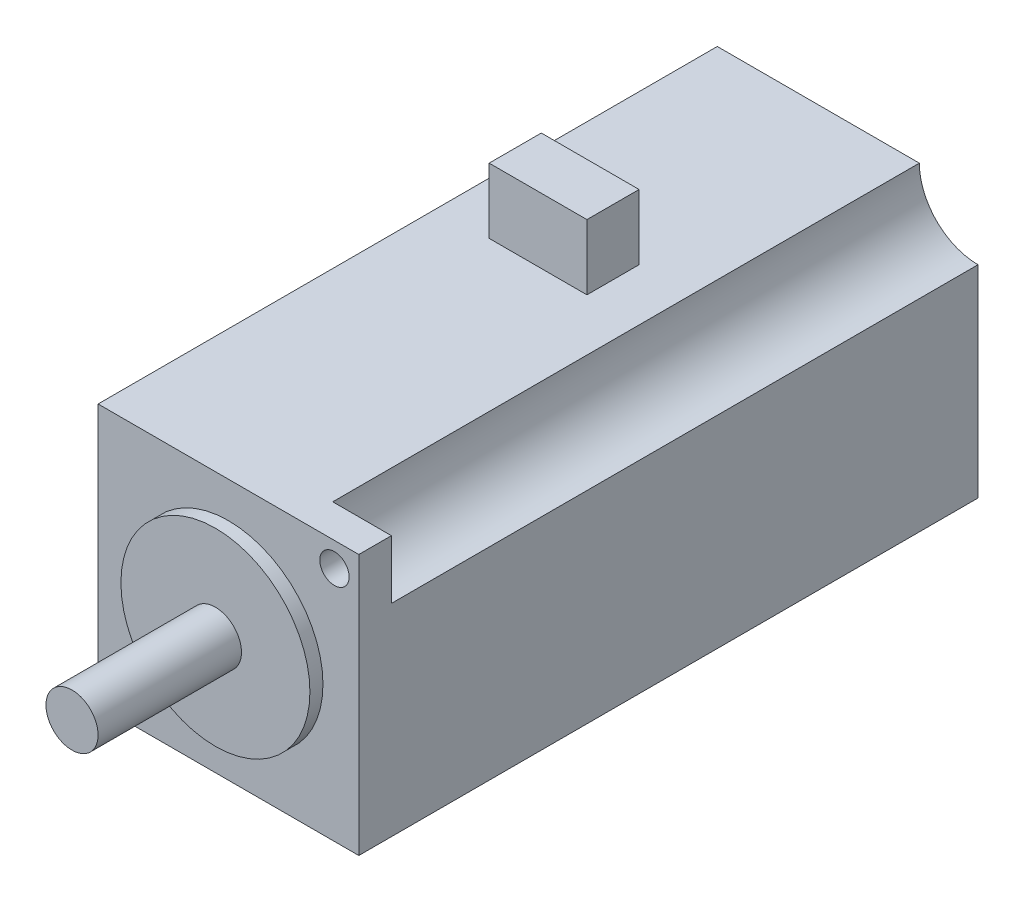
ISO-10303-21;
HEADER;
FILE_DESCRIPTION(('STEP AP214'),'2;1');
FILE_NAME('part.step','',(''),(''),'','','');
FILE_SCHEMA(('AUTOMOTIVE_DESIGN { 1 0 10303 214 1 1 1 1 }'));
ENDSEC;
DATA;
#1=APPLICATION_CONTEXT('core data for automotive mechanical design processes');
#2=APPLICATION_PROTOCOL_DEFINITION('international standard','automotive_design',2000,#1);
#3=PRODUCT_CONTEXT('',#1,'mechanical');
#4=PRODUCT('Part','Part','',(#3));
#5=PRODUCT_RELATED_PRODUCT_CATEGORY('part','',(#4));
#6=PRODUCT_DEFINITION_FORMATION('','',#4);
#7=PRODUCT_DEFINITION_CONTEXT('part definition',#1,'design');
#8=PRODUCT_DEFINITION('design','',#6,#7);
#9=PRODUCT_DEFINITION_SHAPE('','',#8);
#10=(LENGTH_UNIT() NAMED_UNIT(*) SI_UNIT(.MILLI.,.METRE.));
#11=(NAMED_UNIT(*) PLANE_ANGLE_UNIT() SI_UNIT($,.RADIAN.));
#12=(NAMED_UNIT(*) SI_UNIT($,.STERADIAN.) SOLID_ANGLE_UNIT());
#13=UNCERTAINTY_MEASURE_WITH_UNIT(LENGTH_MEASURE(1.E-05),#10,'distance_accuracy_value','');
#14=(GEOMETRIC_REPRESENTATION_CONTEXT(3) GLOBAL_UNCERTAINTY_ASSIGNED_CONTEXT((#13)) GLOBAL_UNIT_ASSIGNED_CONTEXT((#10,
#11,#12)) REPRESENTATION_CONTEXT('',''));
#15=CARTESIAN_POINT('',(0.,0.,0.));
#16=DIRECTION('',(0.,0.,1.));
#17=DIRECTION('',(1.,0.,0.));
#18=AXIS2_PLACEMENT_3D('',#15,#16,#17);
#19=CARTESIAN_POINT('',(7214.09030836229,-378.275127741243,95.));
#20=DIRECTION('',(0.,-1.,0.));
#21=DIRECTION('',(0.,0.,-1.));
#22=AXIS2_PLACEMENT_3D('',#19,#20,#21);
#23=PLANE('',#22);
#24=DIRECTION('',(1.,0.,0.));
#25=VECTOR('',#24,1.);
#26=CARTESIAN_POINT('',(7214.09030836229,-378.275127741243,90.));
#27=LINE('',#26,#25);
#28=CARTESIAN_POINT('',(7205.09030836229,-378.275127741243,90.));
#29=VERTEX_POINT('',#28);
#30=CARTESIAN_POINT('',(7214.09030836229,-378.275127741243,90.));
#31=VERTEX_POINT('',#30);
#32=EDGE_CURVE('E168',#29,#31,#27,.T.);
#33=ORIENTED_EDGE('',*,*,#32,.F.);
#34=DIRECTION('',(0.,0.,-1.));
#35=VECTOR('',#34,1.);
#36=CARTESIAN_POINT('',(7205.09030836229,-378.275127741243,90.));
#37=LINE('',#36,#35);
#38=CARTESIAN_POINT('',(7205.09030836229,-378.275127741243,0.));
#39=VERTEX_POINT('',#38);
#40=EDGE_CURVE('E43',#29,#39,#37,.T.);
#41=ORIENTED_EDGE('',*,*,#40,.T.);
#42=DIRECTION('',(-1.,0.,0.));
#43=VECTOR('',#42,1.);
#44=CARTESIAN_POINT('',(7214.09030836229,-378.275127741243,0.));
#45=LINE('',#44,#43);
#46=CARTESIAN_POINT('',(7174.09030836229,-378.275127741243,0.));
#47=VERTEX_POINT('',#46);
#48=EDGE_CURVE('E209',#39,#47,#45,.T.);
#49=ORIENTED_EDGE('',*,*,#48,.T.);
#50=DIRECTION('',(0.,0.,-1.));
#51=VECTOR('',#50,1.);
#52=CARTESIAN_POINT('',(7174.09030836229,-378.275127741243,95.));
#53=LINE('',#52,#51);
#54=CARTESIAN_POINT('',(7174.09030836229,-378.275127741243,95.));
#55=VERTEX_POINT('',#54);
#56=EDGE_CURVE('E215',#55,#47,#53,.T.);
#57=ORIENTED_EDGE('',*,*,#56,.F.);
#58=DIRECTION('',(-1.,0.,0.));
#59=VECTOR('',#58,1.);
#60=CARTESIAN_POINT('',(7214.09030836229,-378.275127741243,95.));
#61=LINE('',#60,#59);
#62=CARTESIAN_POINT('',(7214.09030836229,-378.275127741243,95.));
#63=VERTEX_POINT('',#62);
#64=EDGE_CURVE('E200',#63,#55,#61,.T.);
#65=ORIENTED_EDGE('',*,*,#64,.F.);
#66=DIRECTION('',(0.,0.,-1.));
#67=VECTOR('',#66,1.);
#68=CARTESIAN_POINT('',(7214.09030836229,-378.275127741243,95.));
#69=LINE('',#68,#67);
#70=EDGE_CURVE('E218',#63,#31,#69,.T.);
#71=ORIENTED_EDGE('',*,*,#70,.T.);
#72=EDGE_LOOP('',(#33,#41,#49,#57,#65,#71));
#73=FACE_BOUND('',#72,.T.);
#74=DIRECTION('',(0.,0.,1.));
#75=VECTOR('',#74,1.);
#76=CARTESIAN_POINT('',(7182.09030836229,-378.275127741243,43.));
#77=LINE('',#76,#75);
#78=CARTESIAN_POINT('',(7182.09030836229,-378.275127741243,35.));
#79=VERTEX_POINT('',#78);
#80=CARTESIAN_POINT('',(7182.09030836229,-378.275127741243,43.));
#81=VERTEX_POINT('',#80);
#82=EDGE_CURVE('E144',#79,#81,#77,.T.);
#83=ORIENTED_EDGE('',*,*,#82,.F.);
#84=DIRECTION('',(-1.,0.,0.));
#85=VECTOR('',#84,1.);
#86=CARTESIAN_POINT('',(7182.09030836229,-378.275127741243,35.));
#87=LINE('',#86,#85);
#88=CARTESIAN_POINT('',(7197.09030836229,-378.275127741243,35.));
#89=VERTEX_POINT('',#88);
#90=EDGE_CURVE('E141',#89,#79,#87,.T.);
#91=ORIENTED_EDGE('',*,*,#90,.F.);
#92=DIRECTION('',(0.,0.,-1.));
#93=VECTOR('',#92,1.);
#94=CARTESIAN_POINT('',(7197.09030836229,-378.275127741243,43.));
#95=LINE('',#94,#93);
#96=CARTESIAN_POINT('',(7197.09030836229,-378.275127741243,43.));
#97=VERTEX_POINT('',#96);
#98=EDGE_CURVE('E55',#97,#89,#95,.T.);
#99=ORIENTED_EDGE('',*,*,#98,.F.);
#100=DIRECTION('',(1.,0.,0.));
#101=VECTOR('',#100,1.);
#102=CARTESIAN_POINT('',(7182.09030836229,-378.275127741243,43.));
#103=LINE('',#102,#101);
#104=EDGE_CURVE('E50',#81,#97,#103,.T.);
#105=ORIENTED_EDGE('',*,*,#104,.F.);
#106=EDGE_LOOP('',(#83,#91,#99,#105));
#107=FACE_BOUND('',#106,.T.);
#108=ADVANCED_FACE('F35',(#73,#107),#23,.F.);
#109=CARTESIAN_POINT('',(7177.826852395,-414.538583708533,95.));
#110=DIRECTION('',(0.,0.,-1.));
#111=DIRECTION('',(-1.,0.,0.));
#112=AXIS2_PLACEMENT_3D('',#109,#110,#111);
#113=CYLINDRICAL_SURFACE('',#112,2.25000000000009);
#114=CARTESIAN_POINT('',(7177.826852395,-414.538583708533,95.));
#115=DIRECTION('',(0.,0.,1.));
#116=DIRECTION('',(1.,0.,0.));
#117=AXIS2_PLACEMENT_3D('',#114,#115,#116);
#118=CIRCLE('',#117,2.25000000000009);
#119=CARTESIAN_POINT('',(7180.076852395,-414.538583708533,95.));
#120=VERTEX_POINT('',#119);
#121=EDGE_CURVE('E185',#120,#120,#118,.T.);
#122=ORIENTED_EDGE('',*,*,#121,.T.);
#123=EDGE_LOOP('',(#122));
#124=FACE_BOUND('',#123,.T.);
#125=CARTESIAN_POINT('',(7177.826852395,-414.538583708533,90.));
#126=DIRECTION('',(0.,0.,-1.));
#127=DIRECTION('',(-1.,0.,0.));
#128=AXIS2_PLACEMENT_3D('',#125,#126,#127);
#129=CIRCLE('',#128,2.25000000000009);
#130=CARTESIAN_POINT('',(7175.576852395,-414.538583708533,90.));
#131=VERTEX_POINT('',#130);
#132=EDGE_CURVE('E154',#131,#131,#129,.T.);
#133=ORIENTED_EDGE('',*,*,#132,.T.);
#134=EDGE_LOOP('',(#133));
#135=FACE_BOUND('',#134,.T.);
#136=ADVANCED_FACE('F230',(#124,#135),#113,.F.);
#137=CARTESIAN_POINT('',(7210.35376432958,-382.011671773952,95.));
#138=DIRECTION('',(0.,0.,-1.));
#139=DIRECTION('',(-1.,0.,0.));
#140=AXIS2_PLACEMENT_3D('',#137,#138,#139);
#141=CYLINDRICAL_SURFACE('',#140,2.25000000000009);
#142=CARTESIAN_POINT('',(7210.35376432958,-382.011671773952,95.));
#143=DIRECTION('',(0.,0.,1.));
#144=DIRECTION('',(1.,0.,0.));
#145=AXIS2_PLACEMENT_3D('',#142,#143,#144);
#146=CIRCLE('',#145,2.25000000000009);
#147=CARTESIAN_POINT('',(7212.60376432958,-382.011671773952,95.));
#148=VERTEX_POINT('',#147);
#149=EDGE_CURVE('E190',#148,#148,#146,.T.);
#150=ORIENTED_EDGE('',*,*,#149,.T.);
#151=EDGE_LOOP('',(#150));
#152=FACE_BOUND('',#151,.T.);
#153=CARTESIAN_POINT('',(7210.35376432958,-382.011671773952,90.));
#154=DIRECTION('',(0.,0.,-1.));
#155=DIRECTION('',(-1.,0.,0.));
#156=AXIS2_PLACEMENT_3D('',#153,#154,#155);
#157=CIRCLE('',#156,2.25000000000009);
#158=CARTESIAN_POINT('',(7208.10376432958,-382.011671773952,90.));
#159=VERTEX_POINT('',#158);
#160=EDGE_CURVE('E166',#159,#159,#157,.T.);
#161=ORIENTED_EDGE('',*,*,#160,.T.);
#162=EDGE_LOOP('',(#161));
#163=FACE_BOUND('',#162,.T.);
#164=ADVANCED_FACE('F318',(#152,#163),#141,.F.);
#165=CARTESIAN_POINT('',(7194.09030836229,-398.275127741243,97.));
#166=DIRECTION('',(0.,0.,1.));
#167=DIRECTION('',(1.,0.,0.));
#168=AXIS2_PLACEMENT_3D('',#165,#166,#167);
#169=PLANE('',#168);
#170=CARTESIAN_POINT('',(7194.09030836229,-398.275127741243,97.));
#171=DIRECTION('',(0.,0.,1.));
#172=DIRECTION('',(1.,0.,0.));
#173=AXIS2_PLACEMENT_3D('',#170,#171,#172);
#174=CIRCLE('',#173,14.4999999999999);
#175=CARTESIAN_POINT('',(7208.59030836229,-398.275127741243,97.));
#176=VERTEX_POINT('',#175);
#177=EDGE_CURVE('E182',#176,#176,#174,.T.);
#178=ORIENTED_EDGE('',*,*,#177,.T.);
#179=EDGE_LOOP('',(#178));
#180=FACE_BOUND('',#179,.T.);
#181=CARTESIAN_POINT('',(7194.09030836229,-398.275127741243,97.));
#182=DIRECTION('',(0.,0.,1.));
#183=DIRECTION('',(1.,0.,0.));
#184=AXIS2_PLACEMENT_3D('',#181,#182,#183);
#185=CIRCLE('',#184,3.99999999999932);
#186=CARTESIAN_POINT('',(7198.09030836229,-398.275127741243,97.));
#187=VERTEX_POINT('',#186);
#188=EDGE_CURVE('E175',#187,#187,#185,.T.);
#189=ORIENTED_EDGE('',*,*,#188,.F.);
#190=EDGE_LOOP('',(#189));
#191=FACE_BOUND('',#190,.T.);
#192=ADVANCED_FACE('F315',(#180,#191),#169,.T.);
#193=CARTESIAN_POINT('',(7214.09030836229,-418.275127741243,95.));
#194=DIRECTION('',(0.,0.,1.));
#195=DIRECTION('',(1.,0.,0.));
#196=AXIS2_PLACEMENT_3D('',#193,#194,#195);
#197=PLANE('',#196);
#198=ORIENTED_EDGE('',*,*,#121,.F.);
#199=EDGE_LOOP('',(#198));
#200=FACE_BOUND('',#199,.T.);
#201=DIRECTION('',(1.,0.,0.));
#202=VECTOR('',#201,1.);
#203=CARTESIAN_POINT('',(7174.09030836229,-418.275127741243,95.));
#204=LINE('',#203,#202);
#205=CARTESIAN_POINT('',(7174.09030836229,-418.275127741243,95.));
#206=VERTEX_POINT('',#205);
#207=CARTESIAN_POINT('',(7214.09030836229,-418.275127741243,95.));
#208=VERTEX_POINT('',#207);
#209=EDGE_CURVE('E194',#206,#208,#204,.T.);
#210=ORIENTED_EDGE('',*,*,#209,.T.);
#211=DIRECTION('',(0.,1.,0.));
#212=VECTOR('',#211,1.);
#213=CARTESIAN_POINT('',(7214.09030836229,-418.275127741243,95.));
#214=LINE('',#213,#212);
#215=EDGE_CURVE('E197',#208,#63,#214,.T.);
#216=ORIENTED_EDGE('',*,*,#215,.T.);
#217=ORIENTED_EDGE('',*,*,#64,.T.);
#218=DIRECTION('',(0.,-1.,0.));
#219=VECTOR('',#218,1.);
#220=CARTESIAN_POINT('',(7174.09030836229,-378.275127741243,95.));
#221=LINE('',#220,#219);
#222=EDGE_CURVE('E202',#55,#206,#221,.T.);
#223=ORIENTED_EDGE('',*,*,#222,.T.);
#224=EDGE_LOOP('',(#210,#216,#217,#223));
#225=FACE_BOUND('',#224,.T.);
#226=ORIENTED_EDGE('',*,*,#149,.F.);
#227=EDGE_LOOP('',(#226));
#228=FACE_BOUND('',#227,.T.);
#229=CARTESIAN_POINT('',(7194.09030836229,-398.275127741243,95.));
#230=DIRECTION('',(0.,0.,1.));
#231=DIRECTION('',(1.,0.,0.));
#232=AXIS2_PLACEMENT_3D('',#229,#230,#231);
#233=CIRCLE('',#232,14.4999999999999);
#234=CARTESIAN_POINT('',(7208.59030836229,-398.275127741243,95.));
#235=VERTEX_POINT('',#234);
#236=EDGE_CURVE('E179',#235,#235,#233,.T.);
#237=ORIENTED_EDGE('',*,*,#236,.F.);
#238=EDGE_LOOP('',(#237));
#239=FACE_BOUND('',#238,.T.);
#240=ADVANCED_FACE('F248',(#200,#225,#228,#239),#197,.T.);
#241=CARTESIAN_POINT('',(7214.09030836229,-418.275127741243,0.));
#242=DIRECTION('',(0.,0.,1.));
#243=DIRECTION('',(1.,0.,0.));
#244=AXIS2_PLACEMENT_3D('',#241,#242,#243);
#245=PLANE('',#244);
#246=DIRECTION('',(1.,0.,0.));
#247=VECTOR('',#246,1.);
#248=CARTESIAN_POINT('',(7174.09030836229,-418.275127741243,0.));
#249=LINE('',#248,#247);
#250=CARTESIAN_POINT('',(7183.09030836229,-418.275127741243,0.));
#251=VERTEX_POINT('',#250);
#252=CARTESIAN_POINT('',(7214.09030836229,-418.275127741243,0.));
#253=VERTEX_POINT('',#252);
#254=EDGE_CURVE('E193',#251,#253,#249,.T.);
#255=ORIENTED_EDGE('',*,*,#254,.F.);
#256=CARTESIAN_POINT('',(7174.09030836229,-418.275127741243,0.));
#257=DIRECTION('',(0.,0.,-1.));
#258=DIRECTION('',(-1.,0.,0.));
#259=AXIS2_PLACEMENT_3D('',#256,#257,#258);
#260=CIRCLE('',#259,9.0000000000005);
#261=CARTESIAN_POINT('',(7174.09030836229,-409.275127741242,0.));
#262=VERTEX_POINT('',#261);
#263=EDGE_CURVE('E145',#262,#251,#260,.T.);
#264=ORIENTED_EDGE('',*,*,#263,.F.);
#265=DIRECTION('',(0.,-1.,0.));
#266=VECTOR('',#265,1.);
#267=CARTESIAN_POINT('',(7174.09030836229,-378.275127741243,0.));
#268=LINE('',#267,#266);
#269=EDGE_CURVE('E198',#47,#262,#268,.T.);
#270=ORIENTED_EDGE('',*,*,#269,.F.);
#271=ORIENTED_EDGE('',*,*,#48,.F.);
#272=CARTESIAN_POINT('',(7214.09030836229,-378.275127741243,0.));
#273=DIRECTION('',(0.,0.,-1.));
#274=DIRECTION('',(-1.,0.,0.));
#275=AXIS2_PLACEMENT_3D('',#272,#273,#274);
#276=CIRCLE('',#275,9.0000000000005);
#277=CARTESIAN_POINT('',(7214.09030836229,-387.275127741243,0.));
#278=VERTEX_POINT('',#277);
#279=EDGE_CURVE('E163',#278,#39,#276,.T.);
#280=ORIENTED_EDGE('',*,*,#279,.F.);
#281=DIRECTION('',(0.,1.,0.));
#282=VECTOR('',#281,1.);
#283=CARTESIAN_POINT('',(7214.09030836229,-418.275127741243,0.));
#284=LINE('',#283,#282);
#285=EDGE_CURVE('E206',#253,#278,#284,.T.);
#286=ORIENTED_EDGE('',*,*,#285,.F.);
#287=EDGE_LOOP('',(#255,#264,#270,#271,#280,#286));
#288=FACE_BOUND('',#287,.T.);
#289=ADVANCED_FACE('F259',(#288),#245,.F.);
#290=CARTESIAN_POINT('',(7174.09030836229,-418.275127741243,95.));
#291=DIRECTION('',(0.,1.,0.));
#292=DIRECTION('',(0.,0.,1.));
#293=AXIS2_PLACEMENT_3D('',#290,#291,#292);
#294=PLANE('',#293);
#295=DIRECTION('',(-1.,0.,0.));
#296=VECTOR('',#295,1.);
#297=CARTESIAN_POINT('',(7174.09030836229,-418.275127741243,90.));
#298=LINE('',#297,#296);
#299=CARTESIAN_POINT('',(7183.09030836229,-418.275127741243,90.));
#300=VERTEX_POINT('',#299);
#301=CARTESIAN_POINT('',(7174.09030836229,-418.275127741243,90.));
#302=VERTEX_POINT('',#301);
#303=EDGE_CURVE('E158',#300,#302,#298,.T.);
#304=ORIENTED_EDGE('',*,*,#303,.F.);
#305=DIRECTION('',(0.,0.,-1.));
#306=VECTOR('',#305,1.);
#307=CARTESIAN_POINT('',(7183.09030836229,-418.275127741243,90.));
#308=LINE('',#307,#306);
#309=EDGE_CURVE('E160',#300,#251,#308,.T.);
#310=ORIENTED_EDGE('',*,*,#309,.T.);
#311=ORIENTED_EDGE('',*,*,#254,.T.);
#312=DIRECTION('',(0.,0.,-1.));
#313=VECTOR('',#312,1.);
#314=CARTESIAN_POINT('',(7214.09030836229,-418.275127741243,95.));
#315=LINE('',#314,#313);
#316=EDGE_CURVE('E221',#208,#253,#315,.T.);
#317=ORIENTED_EDGE('',*,*,#316,.F.);
#318=ORIENTED_EDGE('',*,*,#209,.F.);
#319=DIRECTION('',(0.,0.,-1.));
#320=VECTOR('',#319,1.);
#321=CARTESIAN_POINT('',(7174.09030836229,-418.275127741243,95.));
#322=LINE('',#321,#320);
#323=EDGE_CURVE('E204',#206,#302,#322,.T.);
#324=ORIENTED_EDGE('',*,*,#323,.T.);
#325=EDGE_LOOP('',(#304,#310,#311,#317,#318,#324));
#326=FACE_BOUND('',#325,.T.);
#327=ADVANCED_FACE('F37',(#326),#294,.F.);
#328=CARTESIAN_POINT('',(7214.09030836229,-418.275127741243,95.));
#329=DIRECTION('',(-1.,0.,0.));
#330=DIRECTION('',(0.,0.,1.));
#331=AXIS2_PLACEMENT_3D('',#328,#329,#330);
#332=PLANE('',#331);
#333=ORIENTED_EDGE('',*,*,#285,.T.);
#334=DIRECTION('',(0.,0.,-1.));
#335=VECTOR('',#334,1.);
#336=CARTESIAN_POINT('',(7214.09030836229,-387.275127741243,90.));
#337=LINE('',#336,#335);
#338=CARTESIAN_POINT('',(7214.09030836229,-387.275127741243,90.));
#339=VERTEX_POINT('',#338);
#340=EDGE_CURVE('E172',#278,#339,#337,.F.);
#341=ORIENTED_EDGE('',*,*,#340,.T.);
#342=DIRECTION('',(0.,-1.,0.));
#343=VECTOR('',#342,1.);
#344=CARTESIAN_POINT('',(7214.09030836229,-418.275127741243,90.));
#345=LINE('',#344,#343);
#346=EDGE_CURVE('E170',#31,#339,#345,.T.);
#347=ORIENTED_EDGE('',*,*,#346,.F.);
#348=ORIENTED_EDGE('',*,*,#70,.F.);
#349=ORIENTED_EDGE('',*,*,#215,.F.);
#350=ORIENTED_EDGE('',*,*,#316,.T.);
#351=EDGE_LOOP('',(#333,#341,#347,#348,#349,#350));
#352=FACE_BOUND('',#351,.T.);
#353=ADVANCED_FACE('F264',(#352),#332,.F.);
#354=CARTESIAN_POINT('',(7174.09030836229,-378.275127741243,95.));
#355=DIRECTION('',(1.,0.,0.));
#356=DIRECTION('',(0.,0.,-1.));
#357=AXIS2_PLACEMENT_3D('',#354,#355,#356);
#358=PLANE('',#357);
#359=ORIENTED_EDGE('',*,*,#269,.T.);
#360=DIRECTION('',(0.,0.,-1.));
#361=VECTOR('',#360,1.);
#362=CARTESIAN_POINT('',(7174.09030836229,-409.275127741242,90.));
#363=LINE('',#362,#361);
#364=CARTESIAN_POINT('',(7174.09030836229,-409.275127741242,90.));
#365=VERTEX_POINT('',#364);
#366=EDGE_CURVE('E11',#262,#365,#363,.F.);
#367=ORIENTED_EDGE('',*,*,#366,.T.);
#368=DIRECTION('',(0.,1.,0.));
#369=VECTOR('',#368,1.);
#370=CARTESIAN_POINT('',(7174.09030836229,-378.275127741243,90.));
#371=LINE('',#370,#369);
#372=EDGE_CURVE('E156',#302,#365,#371,.T.);
#373=ORIENTED_EDGE('',*,*,#372,.F.);
#374=ORIENTED_EDGE('',*,*,#323,.F.);
#375=ORIENTED_EDGE('',*,*,#222,.F.);
#376=ORIENTED_EDGE('',*,*,#56,.T.);
#377=EDGE_LOOP('',(#359,#367,#373,#374,#375,#376));
#378=FACE_BOUND('',#377,.T.);
#379=ADVANCED_FACE('F243',(#378),#358,.F.);
#380=CARTESIAN_POINT('',(7194.09030836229,-398.275127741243,97.));
#381=DIRECTION('',(0.,0.,-1.));
#382=DIRECTION('',(-1.,0.,0.));
#383=AXIS2_PLACEMENT_3D('',#380,#381,#382);
#384=CYLINDRICAL_SURFACE('',#383,14.4999999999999);
#385=ORIENTED_EDGE('',*,*,#177,.F.);
#386=EDGE_LOOP('',(#385));
#387=FACE_BOUND('',#386,.T.);
#388=ORIENTED_EDGE('',*,*,#236,.T.);
#389=EDGE_LOOP('',(#388));
#390=FACE_BOUND('',#389,.T.);
#391=ADVANCED_FACE('F313',(#387,#390),#384,.T.);
#392=CARTESIAN_POINT('',(7194.09030836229,-398.275127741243,119.));
#393=DIRECTION('',(0.,0.,-1.));
#394=DIRECTION('',(-1.,0.,0.));
#395=AXIS2_PLACEMENT_3D('',#392,#393,#394);
#396=CYLINDRICAL_SURFACE('',#395,3.99999999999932);
#397=CARTESIAN_POINT('',(7194.09030836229,-398.275127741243,119.));
#398=DIRECTION('',(0.,0.,1.));
#399=DIRECTION('',(1.,0.,0.));
#400=AXIS2_PLACEMENT_3D('',#397,#398,#399);
#401=CIRCLE('',#400,3.99999999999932);
#402=CARTESIAN_POINT('',(7198.09030836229,-398.275127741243,119.));
#403=VERTEX_POINT('',#402);
#404=EDGE_CURVE('E176',#403,#403,#401,.T.);
#405=ORIENTED_EDGE('',*,*,#404,.F.);
#406=EDGE_LOOP('',(#405));
#407=FACE_BOUND('',#406,.T.);
#408=ORIENTED_EDGE('',*,*,#188,.T.);
#409=EDGE_LOOP('',(#408));
#410=FACE_BOUND('',#409,.T.);
#411=ADVANCED_FACE('F309',(#407,#410),#396,.T.);
#412=CARTESIAN_POINT('',(7194.09030836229,-398.275127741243,119.));
#413=DIRECTION('',(0.,0.,1.));
#414=DIRECTION('',(1.,0.,0.));
#415=AXIS2_PLACEMENT_3D('',#412,#413,#414);
#416=PLANE('',#415);
#417=ORIENTED_EDGE('',*,*,#404,.T.);
#418=EDGE_LOOP('',(#417));
#419=FACE_BOUND('',#418,.T.);
#420=ADVANCED_FACE('F305',(#419),#416,.T.);
#421=CARTESIAN_POINT('',(7214.09030836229,-378.275127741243,90.));
#422=DIRECTION('',(0.,0.,-1.));
#423=DIRECTION('',(-1.,0.,0.));
#424=AXIS2_PLACEMENT_3D('',#421,#422,#423);
#425=CYLINDRICAL_SURFACE('',#424,9.0000000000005);
#426=ORIENTED_EDGE('',*,*,#279,.T.);
#427=ORIENTED_EDGE('',*,*,#40,.F.);
#428=CARTESIAN_POINT('',(7214.09030836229,-378.275127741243,90.));
#429=DIRECTION('',(0.,0.,-1.));
#430=DIRECTION('',(-1.,0.,0.));
#431=AXIS2_PLACEMENT_3D('',#428,#429,#430);
#432=CIRCLE('',#431,9.0000000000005);
#433=EDGE_CURVE('E164',#339,#29,#432,.T.);
#434=ORIENTED_EDGE('',*,*,#433,.F.);
#435=ORIENTED_EDGE('',*,*,#340,.F.);
#436=EDGE_LOOP('',(#426,#427,#434,#435));
#437=FACE_BOUND('',#436,.T.);
#438=ADVANCED_FACE('F301',(#437),#425,.F.);
#439=CARTESIAN_POINT('',(7214.09030836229,-378.275127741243,90.));
#440=DIRECTION('',(0.,0.,-1.));
#441=DIRECTION('',(-1.,0.,0.));
#442=AXIS2_PLACEMENT_3D('',#439,#440,#441);
#443=PLANE('',#442);
#444=ORIENTED_EDGE('',*,*,#160,.F.);
#445=EDGE_LOOP('',(#444));
#446=FACE_BOUND('',#445,.T.);
#447=ORIENTED_EDGE('',*,*,#346,.T.);
#448=ORIENTED_EDGE('',*,*,#433,.T.);
#449=ORIENTED_EDGE('',*,*,#32,.T.);
#450=EDGE_LOOP('',(#447,#448,#449));
#451=FACE_BOUND('',#450,.T.);
#452=ADVANCED_FACE('F298',(#446,#451),#443,.T.);
#453=CARTESIAN_POINT('',(7174.09030836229,-418.275127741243,90.));
#454=DIRECTION('',(0.,0.,-1.));
#455=DIRECTION('',(-1.,0.,0.));
#456=AXIS2_PLACEMENT_3D('',#453,#454,#455);
#457=CYLINDRICAL_SURFACE('',#456,9.0000000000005);
#458=CARTESIAN_POINT('',(7174.09030836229,-418.275127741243,90.));
#459=DIRECTION('',(0.,0.,-1.));
#460=DIRECTION('',(-1.,0.,0.));
#461=AXIS2_PLACEMENT_3D('',#458,#459,#460);
#462=CIRCLE('',#461,9.0000000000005);
#463=EDGE_CURVE('E147',#365,#300,#462,.T.);
#464=ORIENTED_EDGE('',*,*,#463,.F.);
#465=ORIENTED_EDGE('',*,*,#366,.F.);
#466=ORIENTED_EDGE('',*,*,#263,.T.);
#467=ORIENTED_EDGE('',*,*,#309,.F.);
#468=EDGE_LOOP('',(#464,#465,#466,#467));
#469=FACE_BOUND('',#468,.T.);
#470=ADVANCED_FACE('F235',(#469),#457,.F.);
#471=CARTESIAN_POINT('',(7174.09030836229,-418.275127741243,90.));
#472=DIRECTION('',(0.,0.,-1.));
#473=DIRECTION('',(-1.,0.,0.));
#474=AXIS2_PLACEMENT_3D('',#471,#472,#473);
#475=PLANE('',#474);
#476=ORIENTED_EDGE('',*,*,#132,.F.);
#477=EDGE_LOOP('',(#476));
#478=FACE_BOUND('',#477,.T.);
#479=ORIENTED_EDGE('',*,*,#303,.T.);
#480=ORIENTED_EDGE('',*,*,#372,.T.);
#481=ORIENTED_EDGE('',*,*,#463,.T.);
#482=EDGE_LOOP('',(#479,#480,#481));
#483=FACE_BOUND('',#482,.T.);
#484=ADVANCED_FACE('F232',(#478,#483),#475,.T.);
#485=CARTESIAN_POINT('',(7182.09030836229,-368.275127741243,43.));
#486=DIRECTION('',(1.,0.,0.));
#487=DIRECTION('',(0.,0.,-1.));
#488=AXIS2_PLACEMENT_3D('',#485,#486,#487);
#489=PLANE('',#488);
#490=ORIENTED_EDGE('',*,*,#82,.T.);
#491=DIRECTION('',(0.,-1.,0.));
#492=VECTOR('',#491,1.);
#493=CARTESIAN_POINT('',(7182.09030836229,-368.275127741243,43.));
#494=LINE('',#493,#492);
#495=CARTESIAN_POINT('',(7182.09030836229,-368.275127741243,43.));
#496=VERTEX_POINT('',#495);
#497=EDGE_CURVE('E125',#496,#81,#494,.T.);
#498=ORIENTED_EDGE('',*,*,#497,.F.);
#499=DIRECTION('',(0.,0.,1.));
#500=VECTOR('',#499,1.);
#501=CARTESIAN_POINT('',(7182.09030836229,-368.275127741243,43.));
#502=LINE('',#501,#500);
#503=CARTESIAN_POINT('',(7182.09030836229,-368.275127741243,35.));
#504=VERTEX_POINT('',#503);
#505=EDGE_CURVE('E132',#504,#496,#502,.T.);
#506=ORIENTED_EDGE('',*,*,#505,.F.);
#507=DIRECTION('',(0.,-1.,0.));
#508=VECTOR('',#507,1.);
#509=CARTESIAN_POINT('',(7182.09030836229,-368.275127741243,35.));
#510=LINE('',#509,#508);
#511=EDGE_CURVE('E274',#504,#79,#510,.T.);
#512=ORIENTED_EDGE('',*,*,#511,.T.);
#513=EDGE_LOOP('',(#490,#498,#506,#512));
#514=FACE_BOUND('',#513,.T.);
#515=ADVANCED_FACE('F143',(#514),#489,.F.);
#516=CARTESIAN_POINT('',(7182.09030836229,-368.275127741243,43.));
#517=DIRECTION('',(0.,0.,-1.));
#518=DIRECTION('',(-1.,0.,0.));
#519=AXIS2_PLACEMENT_3D('',#516,#517,#518);
#520=PLANE('',#519);
#521=ORIENTED_EDGE('',*,*,#104,.T.);
#522=DIRECTION('',(0.,-1.,0.));
#523=VECTOR('',#522,1.);
#524=CARTESIAN_POINT('',(7197.09030836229,-368.275127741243,43.));
#525=LINE('',#524,#523);
#526=CARTESIAN_POINT('',(7197.09030836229,-368.275127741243,43.));
#527=VERTEX_POINT('',#526);
#528=EDGE_CURVE('E128',#527,#97,#525,.T.);
#529=ORIENTED_EDGE('',*,*,#528,.F.);
#530=DIRECTION('',(1.,0.,0.));
#531=VECTOR('',#530,1.);
#532=CARTESIAN_POINT('',(7182.09030836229,-368.275127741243,43.));
#533=LINE('',#532,#531);
#534=EDGE_CURVE('E121',#496,#527,#533,.T.);
#535=ORIENTED_EDGE('',*,*,#534,.F.);
#536=ORIENTED_EDGE('',*,*,#497,.T.);
#537=EDGE_LOOP('',(#521,#529,#535,#536));
#538=FACE_BOUND('',#537,.T.);
#539=ADVANCED_FACE('F123',(#538),#520,.F.);
#540=CARTESIAN_POINT('',(7197.09030836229,-368.275127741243,43.));
#541=DIRECTION('',(-1.,0.,0.));
#542=DIRECTION('',(0.,0.,1.));
#543=AXIS2_PLACEMENT_3D('',#540,#541,#542);
#544=PLANE('',#543);
#545=ORIENTED_EDGE('',*,*,#98,.T.);
#546=DIRECTION('',(0.,-1.,0.));
#547=VECTOR('',#546,1.);
#548=CARTESIAN_POINT('',(7197.09030836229,-368.275127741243,35.));
#549=LINE('',#548,#547);
#550=CARTESIAN_POINT('',(7197.09030836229,-368.275127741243,35.));
#551=VERTEX_POINT('',#550);
#552=EDGE_CURVE('E149',#551,#89,#549,.T.);
#553=ORIENTED_EDGE('',*,*,#552,.F.);
#554=DIRECTION('',(0.,0.,-1.));
#555=VECTOR('',#554,1.);
#556=CARTESIAN_POINT('',(7197.09030836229,-368.275127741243,43.));
#557=LINE('',#556,#555);
#558=EDGE_CURVE('E131',#527,#551,#557,.T.);
#559=ORIENTED_EDGE('',*,*,#558,.F.);
#560=ORIENTED_EDGE('',*,*,#528,.T.);
#561=EDGE_LOOP('',(#545,#553,#559,#560));
#562=FACE_BOUND('',#561,.T.);
#563=ADVANCED_FACE('F283',(#562),#544,.F.);
#564=CARTESIAN_POINT('',(7182.09030836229,-368.275127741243,35.));
#565=DIRECTION('',(0.,0.,1.));
#566=DIRECTION('',(1.,0.,0.));
#567=AXIS2_PLACEMENT_3D('',#564,#565,#566);
#568=PLANE('',#567);
#569=ORIENTED_EDGE('',*,*,#90,.T.);
#570=ORIENTED_EDGE('',*,*,#511,.F.);
#571=DIRECTION('',(-1.,0.,0.));
#572=VECTOR('',#571,1.);
#573=CARTESIAN_POINT('',(7182.09030836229,-368.275127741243,35.));
#574=LINE('',#573,#572);
#575=EDGE_CURVE('E137',#551,#504,#574,.T.);
#576=ORIENTED_EDGE('',*,*,#575,.F.);
#577=ORIENTED_EDGE('',*,*,#552,.T.);
#578=EDGE_LOOP('',(#569,#570,#576,#577));
#579=FACE_BOUND('',#578,.T.);
#580=ADVANCED_FACE('F273',(#579),#568,.F.);
#581=CARTESIAN_POINT('',(7182.09030836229,-368.275127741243,35.));
#582=DIRECTION('',(0.,-1.,0.));
#583=DIRECTION('',(0.,0.,-1.));
#584=AXIS2_PLACEMENT_3D('',#581,#582,#583);
#585=PLANE('',#584);
#586=ORIENTED_EDGE('',*,*,#505,.T.);
#587=ORIENTED_EDGE('',*,*,#534,.T.);
#588=ORIENTED_EDGE('',*,*,#558,.T.);
#589=ORIENTED_EDGE('',*,*,#575,.T.);
#590=EDGE_LOOP('',(#586,#587,#588,#589));
#591=FACE_BOUND('',#590,.T.);
#592=ADVANCED_FACE('F135',(#591),#585,.F.);
#593=CLOSED_SHELL('',(#108,#136,#164,#192,#240,#289,#327,#353,#379,#391,#411,#420,#438,#452,
#470,#484,#515,#539,#563,#580,#592));
#594=MANIFOLD_SOLID_BREP('B2',#593);
#595=ADVANCED_BREP_SHAPE_REPRESENTATION('',(#18,#594),#14);
#596=SHAPE_DEFINITION_REPRESENTATION(#9,#595);
ENDSEC;
END-ISO-10303-21;
